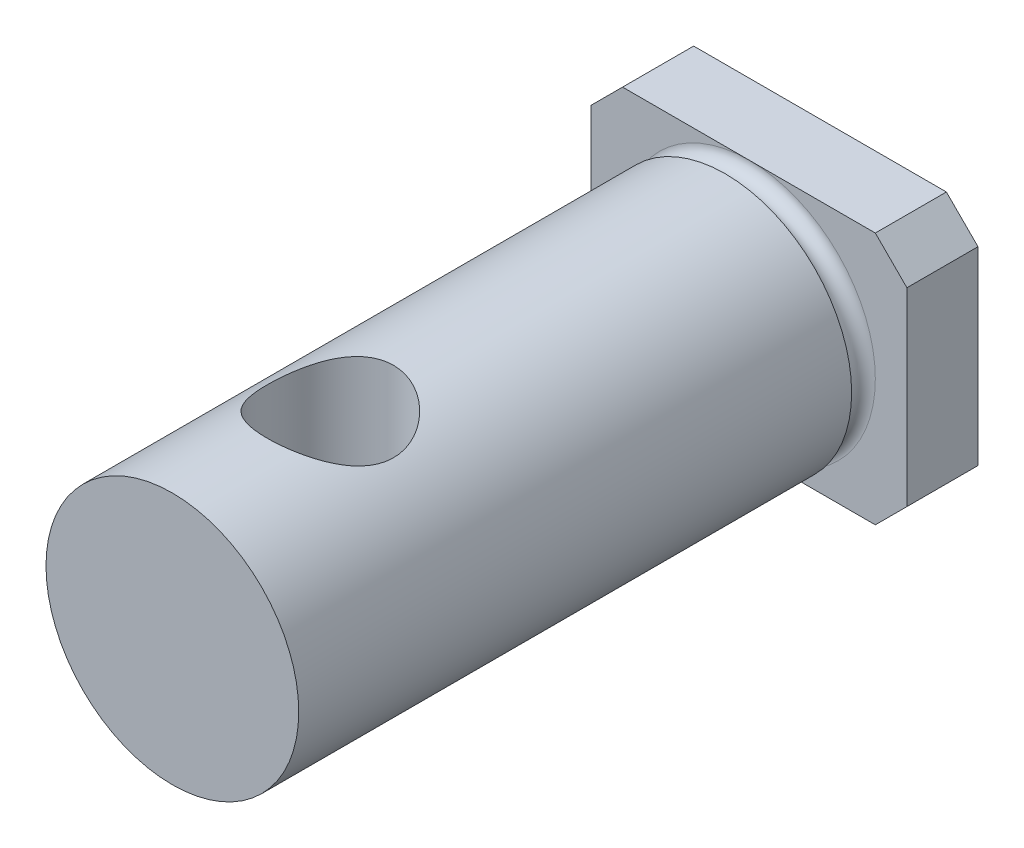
ISO-10303-21;
HEADER;
FILE_DESCRIPTION(('STEP AP214'),'2;1');
FILE_NAME('part.step','',(''),(''),'','','');
FILE_SCHEMA(('AUTOMOTIVE_DESIGN { 1 0 10303 214 1 1 1 1 }'));
ENDSEC;
DATA;
#1=APPLICATION_CONTEXT('core data for automotive mechanical design processes');
#2=APPLICATION_PROTOCOL_DEFINITION('international standard','automotive_design',2000,#1);
#3=PRODUCT_CONTEXT('',#1,'mechanical');
#4=PRODUCT('Part','Part','',(#3));
#5=PRODUCT_RELATED_PRODUCT_CATEGORY('part','',(#4));
#6=PRODUCT_DEFINITION_FORMATION('','',#4);
#7=PRODUCT_DEFINITION_CONTEXT('part definition',#1,'design');
#8=PRODUCT_DEFINITION('design','',#6,#7);
#9=PRODUCT_DEFINITION_SHAPE('','',#8);
#10=(LENGTH_UNIT() NAMED_UNIT(*) SI_UNIT(.MILLI.,.METRE.));
#11=(NAMED_UNIT(*) PLANE_ANGLE_UNIT() SI_UNIT($,.RADIAN.));
#12=(NAMED_UNIT(*) SI_UNIT($,.STERADIAN.) SOLID_ANGLE_UNIT());
#13=UNCERTAINTY_MEASURE_WITH_UNIT(LENGTH_MEASURE(1.E-05),#10,'distance_accuracy_value','');
#14=(GEOMETRIC_REPRESENTATION_CONTEXT(3) GLOBAL_UNCERTAINTY_ASSIGNED_CONTEXT((#13)) GLOBAL_UNIT_ASSIGNED_CONTEXT((#10,
#11,#12)) REPRESENTATION_CONTEXT('',''));
#15=CARTESIAN_POINT('',(0.,0.,0.));
#16=DIRECTION('',(0.,0.,1.));
#17=DIRECTION('',(1.,0.,0.));
#18=AXIS2_PLACEMENT_3D('',#15,#16,#17);
#19=CARTESIAN_POINT('',(0.,0.,20.5));
#20=DIRECTION('',(0.,0.,-1.));
#21=DIRECTION('',(-1.,0.,0.));
#22=AXIS2_PLACEMENT_3D('',#19,#20,#21);
#23=CYLINDRICAL_SURFACE('',#22,4.);
#24=CARTESIAN_POINT('',(0.,-4.,17.5));
#25=CARTESIAN_POINT('',(-0.105143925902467,-3.99999426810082,17.4999933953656));
#26=CARTESIAN_POINT('',(-0.210413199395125,-3.99580982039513,17.4916598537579));
#27=CARTESIAN_POINT('',(-0.417840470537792,-3.97948312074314,17.4586942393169));
#28=CARTESIAN_POINT('',(-0.519992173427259,-3.96732575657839,17.4340312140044));
#29=CARTESIAN_POINT('',(-0.717867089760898,-3.93632558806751,17.3696123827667));
#30=CARTESIAN_POINT('',(-0.813613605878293,-3.91750878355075,17.3299152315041));
#31=CARTESIAN_POINT('',(-0.996945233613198,-3.87491553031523,17.23685875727));
#32=CARTESIAN_POINT('',(-1.08453098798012,-3.8511394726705,17.1835005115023));
#33=CARTESIAN_POINT('',(-1.25501563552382,-3.79912516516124,17.0609655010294));
#34=CARTESIAN_POINT('',(-1.33731042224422,-3.77070398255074,16.9910270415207));
#35=CARTESIAN_POINT('',(-1.48955888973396,-3.71319940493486,16.8389570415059));
#36=CARTESIAN_POINT('',(-1.55950316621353,-3.68411552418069,16.7568162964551));
#37=CARTESIAN_POINT('',(-1.69050400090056,-3.62597902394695,16.5750333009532));
#38=CARTESIAN_POINT('',(-1.75045067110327,-3.59710373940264,16.4745278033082));
#39=CARTESIAN_POINT('',(-1.85233645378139,-3.54571957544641,16.2632653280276));
#40=CARTESIAN_POINT('',(-1.89428842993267,-3.52320615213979,16.1525157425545));
#41=CARTESIAN_POINT('',(-1.95626488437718,-3.48915734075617,15.9306697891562));
#42=CARTESIAN_POINT('',(-1.97745171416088,-3.47704543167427,15.8199910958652));
#43=CARTESIAN_POINT('',(-2.00085398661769,-3.46363779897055,15.596042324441));
#44=CARTESIAN_POINT('',(-2.00308817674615,-3.46233138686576,15.4827749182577));
#45=CARTESIAN_POINT('',(-1.98937457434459,-3.47021860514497,15.2714279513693));
#46=CARTESIAN_POINT('',(-1.97556911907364,-3.47817527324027,15.1731519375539));
#47=CARTESIAN_POINT('',(-1.93387969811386,-3.501524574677,14.9805561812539));
#48=CARTESIAN_POINT('',(-1.9059912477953,-3.51691957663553,14.8862377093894));
#49=CARTESIAN_POINT('',(-1.83641956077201,-3.55374952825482,14.7015417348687));
#50=CARTESIAN_POINT('',(-1.79443013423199,-3.57531681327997,14.6113072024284));
#51=CARTESIAN_POINT('',(-1.698083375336,-3.62206808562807,14.43873141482));
#52=CARTESIAN_POINT('',(-1.64372048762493,-3.64725369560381,14.3563937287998));
#53=CARTESIAN_POINT('',(-1.51613210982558,-3.70226315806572,14.1909574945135));
#54=CARTESIAN_POINT('',(-1.44138891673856,-3.73227020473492,14.1090862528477));
#55=CARTESIAN_POINT('',(-1.27911115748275,-3.79095246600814,13.9585291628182));
#56=CARTESIAN_POINT('',(-1.19157051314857,-3.81962703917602,13.8898496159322));
#57=CARTESIAN_POINT('',(-1.0010330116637,-3.87403974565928,13.7646286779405));
#58=CARTESIAN_POINT('',(-0.897507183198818,-3.89957968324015,13.7087990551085));
#59=CARTESIAN_POINT('',(-0.680932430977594,-3.94315762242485,13.615805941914));
#60=CARTESIAN_POINT('',(-0.567891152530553,-3.96120157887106,13.5786276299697));
#61=CARTESIAN_POINT('',(-0.345532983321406,-3.98648667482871,13.5270491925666));
#62=CARTESIAN_POINT('',(-0.236683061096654,-3.9944987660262,13.5110175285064));
#63=CARTESIAN_POINT('',(-0.0175591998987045,-4.00146026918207,13.497070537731));
#64=CARTESIAN_POINT('',(0.0927140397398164,-4.00041397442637,13.4991466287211));
#65=CARTESIAN_POINT('',(0.302465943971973,-3.9898238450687,13.5204133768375));
#66=CARTESIAN_POINT('',(0.40211881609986,-3.98094491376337,13.53826506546));
#67=CARTESIAN_POINT('',(0.596813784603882,-3.95644342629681,13.5884761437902));
#68=CARTESIAN_POINT('',(0.691855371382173,-3.94082012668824,13.620837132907));
#69=CARTESIAN_POINT('',(0.877777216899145,-3.90368502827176,13.6999969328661));
#70=CARTESIAN_POINT('',(0.968460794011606,-3.88201763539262,13.7471821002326));
#71=CARTESIAN_POINT('',(1.14092272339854,-3.83487948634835,13.8542150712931));
#72=CARTESIAN_POINT('',(1.22269725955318,-3.80940711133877,13.9140682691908));
#73=CARTESIAN_POINT('',(1.38353537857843,-3.75416442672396,14.0515208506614));
#74=CARTESIAN_POINT('',(1.46154415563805,-3.72421769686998,14.1302857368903));
#75=CARTESIAN_POINT('',(1.60371264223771,-3.6652478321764,14.2998503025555));
#76=CARTESIAN_POINT('',(1.66786277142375,-3.63622534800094,14.3906582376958));
#77=CARTESIAN_POINT('',(1.78341582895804,-3.58102384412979,14.587287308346));
#78=CARTESIAN_POINT('',(1.8340509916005,-3.55505059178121,14.693622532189));
#79=CARTESIAN_POINT('',(1.91616565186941,-3.51148144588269,14.9150201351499));
#80=CARTESIAN_POINT('',(1.94766983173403,-3.493874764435,15.0300710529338));
#81=CARTESIAN_POINT('',(1.98772337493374,-3.47123002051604,15.2538204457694));
#82=CARTESIAN_POINT('',(1.9981859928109,-3.4651476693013,15.3620685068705));
#83=CARTESIAN_POINT('',(2.0013783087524,-3.46330709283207,15.5788941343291));
#84=CARTESIAN_POINT('',(1.99411569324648,-3.4675443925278,15.6874715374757));
#85=CARTESIAN_POINT('',(1.96385225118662,-3.48475724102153,15.8909670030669));
#86=CARTESIAN_POINT('',(1.94241662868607,-3.49686188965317,15.9862009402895));
#87=CARTESIAN_POINT('',(1.88635071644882,-3.52742032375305,16.1716162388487));
#88=CARTESIAN_POINT('',(1.85171618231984,-3.54587615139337,16.2617959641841));
#89=CARTESIAN_POINT('',(1.76763149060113,-3.58857060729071,16.4412497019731));
#90=CARTESIAN_POINT('',(1.7173422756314,-3.61311444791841,16.5300558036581));
#91=CARTESIAN_POINT('',(1.60430194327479,-3.66470663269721,16.6985490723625));
#92=CARTESIAN_POINT('',(1.54154434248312,-3.69175627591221,16.7782314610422));
#93=CARTESIAN_POINT('',(1.39640665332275,-3.74924646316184,16.9362839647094));
#94=CARTESIAN_POINT('',(1.31256884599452,-3.77969966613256,17.0133182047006));
#95=CARTESIAN_POINT('',(1.13230961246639,-3.83755504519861,17.1525259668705));
#96=CARTESIAN_POINT('',(1.03588144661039,-3.8649555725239,17.2146914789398));
#97=CARTESIAN_POINT('',(0.831863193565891,-3.91396019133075,17.3224727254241));
#98=CARTESIAN_POINT('',(0.724199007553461,-3.93552192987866,17.3679683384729));
#99=CARTESIAN_POINT('',(0.501484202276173,-3.97002682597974,17.4396163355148));
#100=CARTESIAN_POINT('',(0.386455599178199,-3.98299446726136,17.4658236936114));
#101=CARTESIAN_POINT('',(0.22520389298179,-3.99390923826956,17.4877948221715));
#102=CARTESIAN_POINT('',(0.180323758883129,-3.99618730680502,17.4923652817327));
#103=CARTESIAN_POINT('',(0.0903034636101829,-3.99923393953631,17.4984693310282));
#104=CARTESIAN_POINT('',(0.0451632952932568,-4.00000246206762,17.5000028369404));
#105=CARTESIAN_POINT('',(0.,-4.,17.5));
#106=B_SPLINE_CURVE_WITH_KNOTS('',3,(#24,#25,#26,#27,#28,#29,#30,#31,#32,#33,#34,#35,#36,#37,
#38,#39,#40,#41,#42,#43,#44,#45,#46,#47,#48,#49,#50,#51,#52,#53,#54,#55,#56,#57,#58,#59,#60,#61,
#62,#63,#64,#65,#66,#67,#68,#69,#70,#71,#72,#73,#74,#75,#76,#77,#78,#79,#80,#81,#82,#83,#84,#85,
#86,#87,#88,#89,#90,#91,#92,#93,#94,#95,#96,#97,#98,#99,#100,#101,#102,#103,#104,#105),
.UNSPECIFIED.,.T.,.F.,(4,2,2,2,2,2,2,2,2,2,2,2,2,2,2,2,2,2,2,2,2,2,2,2,2,2,2,2,2,2,2,2,2,2,2,2,
2,2,2,2,4),(0.,0.315248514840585,0.631096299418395,0.945724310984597,1.26032752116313,
1.59396351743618,1.92785247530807,2.28763452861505,2.64715895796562,2.98516024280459,
3.32282714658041,3.62011424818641,3.91749607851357,4.22180480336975,4.52625042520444,
4.86929882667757,5.21251069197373,5.57166044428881,5.93052433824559,6.25966580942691,
6.58865129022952,6.89213813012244,7.19565843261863,7.50785712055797,7.82018901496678,
8.16319221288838,8.50643177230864,8.86629364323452,9.22569023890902,9.55058615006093,
9.87534119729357,10.1691586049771,10.463070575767,10.7767291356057,11.0905512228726,
11.4425048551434,11.7946476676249,12.1492802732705,12.502898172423,12.6383056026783,
12.7737167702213),.UNSPECIFIED.);
#107=CARTESIAN_POINT('',(0.,-4.,17.5));
#108=VERTEX_POINT('',#107);
#109=EDGE_CURVE('E202',#108,#108,#106,.T.);
#110=ORIENTED_EDGE('',*,*,#109,.F.);
#111=EDGE_LOOP('',(#110));
#112=FACE_BOUND('',#111,.T.);
#113=CARTESIAN_POINT('',(0.,0.,20.5));
#114=DIRECTION('',(0.,0.,1.));
#115=DIRECTION('',(1.,0.,0.));
#116=AXIS2_PLACEMENT_3D('',#113,#114,#115);
#117=CIRCLE('',#116,4.);
#118=CARTESIAN_POINT('',(4.,0.,20.5));
#119=VERTEX_POINT('',#118);
#120=EDGE_CURVE('E106',#119,#119,#117,.T.);
#121=ORIENTED_EDGE('',*,*,#120,.F.);
#122=EDGE_LOOP('',(#121));
#123=FACE_BOUND('',#122,.T.);
#124=CARTESIAN_POINT('',(0.,0.,3.));
#125=DIRECTION('',(0.,0.,-1.));
#126=DIRECTION('',(-1.,0.,0.));
#127=AXIS2_PLACEMENT_3D('',#124,#125,#126);
#128=CIRCLE('',#127,4.);
#129=CARTESIAN_POINT('',(-4.,0.,3.));
#130=VERTEX_POINT('',#129);
#131=EDGE_CURVE('E34',#130,#130,#128,.T.);
#132=ORIENTED_EDGE('',*,*,#131,.F.);
#133=EDGE_LOOP('',(#132));
#134=FACE_BOUND('',#133,.T.);
#135=CARTESIAN_POINT('',(0.,4.,13.5));
#136=CARTESIAN_POINT('',(0.105143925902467,3.99999426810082,13.5000066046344));
#137=CARTESIAN_POINT('',(0.210413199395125,3.99580982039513,13.5083401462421));
#138=CARTESIAN_POINT('',(0.417840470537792,3.97948312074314,13.5413057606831));
#139=CARTESIAN_POINT('',(0.519992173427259,3.96732575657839,13.5659687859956));
#140=CARTESIAN_POINT('',(0.717867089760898,3.93632558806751,13.6303876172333));
#141=CARTESIAN_POINT('',(0.813613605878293,3.91750878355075,13.6700847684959));
#142=CARTESIAN_POINT('',(0.996945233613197,3.87491553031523,13.76314124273));
#143=CARTESIAN_POINT('',(1.08453098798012,3.85113947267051,13.8164994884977));
#144=CARTESIAN_POINT('',(1.25501563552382,3.79912516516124,13.9390344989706));
#145=CARTESIAN_POINT('',(1.33731042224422,3.77070398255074,14.0089729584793));
#146=CARTESIAN_POINT('',(1.48955888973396,3.71319940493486,14.1610429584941));
#147=CARTESIAN_POINT('',(1.55950316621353,3.68411552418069,14.2431837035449));
#148=CARTESIAN_POINT('',(1.69050400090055,3.62597902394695,14.4249666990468));
#149=CARTESIAN_POINT('',(1.75045067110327,3.59710373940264,14.5254721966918));
#150=CARTESIAN_POINT('',(1.85233645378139,3.54571957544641,14.7367346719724));
#151=CARTESIAN_POINT('',(1.89428842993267,3.52320615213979,14.8474842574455));
#152=CARTESIAN_POINT('',(1.95626488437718,3.48915734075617,15.0693302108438));
#153=CARTESIAN_POINT('',(1.97745171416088,3.47704543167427,15.1800089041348));
#154=CARTESIAN_POINT('',(2.00085398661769,3.46363779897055,15.403957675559));
#155=CARTESIAN_POINT('',(2.00308817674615,3.46233138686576,15.5172250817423));
#156=CARTESIAN_POINT('',(1.98937457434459,3.47021860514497,15.7285720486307));
#157=CARTESIAN_POINT('',(1.97556911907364,3.47817527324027,15.8268480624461));
#158=CARTESIAN_POINT('',(1.93387969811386,3.501524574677,16.0194438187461));
#159=CARTESIAN_POINT('',(1.9059912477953,3.51691957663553,16.1137622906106));
#160=CARTESIAN_POINT('',(1.83641956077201,3.55374952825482,16.2984582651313));
#161=CARTESIAN_POINT('',(1.79443013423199,3.57531681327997,16.3886927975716));
#162=CARTESIAN_POINT('',(1.69808337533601,3.62206808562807,16.56126858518));
#163=CARTESIAN_POINT('',(1.64372048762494,3.64725369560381,16.6436062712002));
#164=CARTESIAN_POINT('',(1.51613210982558,3.70226315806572,16.8090425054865));
#165=CARTESIAN_POINT('',(1.44138891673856,3.73227020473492,16.8909137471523));
#166=CARTESIAN_POINT('',(1.27911115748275,3.79095246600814,17.0414708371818));
#167=CARTESIAN_POINT('',(1.19157051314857,3.81962703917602,17.1101503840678));
#168=CARTESIAN_POINT('',(1.0010330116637,3.87403974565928,17.2353713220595));
#169=CARTESIAN_POINT('',(0.897507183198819,3.89957968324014,17.2912009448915));
#170=CARTESIAN_POINT('',(0.680932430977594,3.94315762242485,17.384194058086));
#171=CARTESIAN_POINT('',(0.567891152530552,3.96120157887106,17.4213723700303));
#172=CARTESIAN_POINT('',(0.345532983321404,3.98648667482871,17.4729508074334));
#173=CARTESIAN_POINT('',(0.236683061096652,3.9944987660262,17.4889824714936));
#174=CARTESIAN_POINT('',(0.0175591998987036,4.00146026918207,17.502929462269));
#175=CARTESIAN_POINT('',(-0.092714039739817,4.00041397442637,17.5008533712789));
#176=CARTESIAN_POINT('',(-0.302465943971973,3.9898238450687,17.4795866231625));
#177=CARTESIAN_POINT('',(-0.402118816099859,3.98094491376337,17.46173493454));
#178=CARTESIAN_POINT('',(-0.596813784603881,3.95644342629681,17.4115238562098));
#179=CARTESIAN_POINT('',(-0.691855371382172,3.94082012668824,17.379162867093));
#180=CARTESIAN_POINT('',(-0.877777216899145,3.90368502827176,17.3000030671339));
#181=CARTESIAN_POINT('',(-0.968460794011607,3.88201763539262,17.2528178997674));
#182=CARTESIAN_POINT('',(-1.14092272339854,3.83487948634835,17.1457849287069));
#183=CARTESIAN_POINT('',(-1.22269725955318,3.80940711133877,17.0859317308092));
#184=CARTESIAN_POINT('',(-1.38353537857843,3.75416442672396,16.9484791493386));
#185=CARTESIAN_POINT('',(-1.46154415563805,3.72421769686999,16.8697142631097));
#186=CARTESIAN_POINT('',(-1.60371264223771,3.6652478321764,16.7001496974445));
#187=CARTESIAN_POINT('',(-1.66786277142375,3.63622534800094,16.6093417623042));
#188=CARTESIAN_POINT('',(-1.78341582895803,3.58102384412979,16.4127126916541));
#189=CARTESIAN_POINT('',(-1.8340509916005,3.55505059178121,16.306377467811));
#190=CARTESIAN_POINT('',(-1.91616565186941,3.51148144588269,16.0849798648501));
#191=CARTESIAN_POINT('',(-1.94766983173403,3.493874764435,15.9699289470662));
#192=CARTESIAN_POINT('',(-1.98772337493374,3.47123002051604,15.7461795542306));
#193=CARTESIAN_POINT('',(-1.9981859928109,3.4651476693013,15.6379314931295));
#194=CARTESIAN_POINT('',(-2.0013783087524,3.46330709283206,15.421105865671));
#195=CARTESIAN_POINT('',(-1.99411569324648,3.4675443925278,15.3125284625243));
#196=CARTESIAN_POINT('',(-1.96385225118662,3.48475724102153,15.1090329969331));
#197=CARTESIAN_POINT('',(-1.94241662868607,3.49686188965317,15.0137990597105));
#198=CARTESIAN_POINT('',(-1.88635071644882,3.52742032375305,14.8283837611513));
#199=CARTESIAN_POINT('',(-1.85171618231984,3.54587615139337,14.7382040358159));
#200=CARTESIAN_POINT('',(-1.76763149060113,3.58857060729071,14.5587502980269));
#201=CARTESIAN_POINT('',(-1.7173422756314,3.61311444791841,14.4699441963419));
#202=CARTESIAN_POINT('',(-1.60430194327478,3.66470663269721,14.3014509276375));
#203=CARTESIAN_POINT('',(-1.54154434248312,3.69175627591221,14.2217685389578));
#204=CARTESIAN_POINT('',(-1.39640665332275,3.74924646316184,14.0637160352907));
#205=CARTESIAN_POINT('',(-1.31256884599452,3.77969966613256,13.9866817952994));
#206=CARTESIAN_POINT('',(-1.1323096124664,3.83755504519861,13.8474740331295));
#207=CARTESIAN_POINT('',(-1.0358814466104,3.8649555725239,13.7853085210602));
#208=CARTESIAN_POINT('',(-0.831863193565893,3.91396019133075,13.6775272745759));
#209=CARTESIAN_POINT('',(-0.724199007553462,3.93552192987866,13.6320316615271));
#210=CARTESIAN_POINT('',(-0.501484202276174,3.97002682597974,13.5603836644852));
#211=CARTESIAN_POINT('',(-0.3864555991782,3.98299446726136,13.5341763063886));
#212=CARTESIAN_POINT('',(-0.225203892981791,3.99390923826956,13.5122051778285));
#213=CARTESIAN_POINT('',(-0.18032375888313,3.99618730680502,13.5076347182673));
#214=CARTESIAN_POINT('',(-0.0903034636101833,3.99923393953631,13.5015306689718));
#215=CARTESIAN_POINT('',(-0.0451632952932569,4.00000246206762,13.4999971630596));
#216=CARTESIAN_POINT('',(0.,4.,13.5));
#217=B_SPLINE_CURVE_WITH_KNOTS('',3,(#135,#136,#137,#138,#139,#140,#141,#142,#143,#144,#145,
#146,#147,#148,#149,#150,#151,#152,#153,#154,#155,#156,#157,#158,#159,#160,#161,#162,#163,#164,
#165,#166,#167,#168,#169,#170,#171,#172,#173,#174,#175,#176,#177,#178,#179,#180,#181,#182,#183,
#184,#185,#186,#187,#188,#189,#190,#191,#192,#193,#194,#195,#196,#197,#198,#199,#200,#201,#202,
#203,#204,#205,#206,#207,#208,#209,#210,#211,#212,#213,#214,#215,#216),.UNSPECIFIED.,.T.,.F.,(4,
2,2,2,2,2,2,2,2,2,2,2,2,2,2,2,2,2,2,2,2,2,2,2,2,2,2,2,2,2,2,2,2,2,2,2,2,2,2,2,4),(0.,
0.315248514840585,0.631096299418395,0.945724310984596,1.26032752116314,1.59396351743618,
1.92785247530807,2.28763452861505,2.64715895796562,2.98516024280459,3.32282714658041,
3.62011424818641,3.91749607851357,4.22180480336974,4.52625042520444,4.86929882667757,
5.21251069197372,5.57166044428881,5.93052433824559,6.25966580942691,6.58865129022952,
6.89213813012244,7.19565843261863,7.50785712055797,7.82018901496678,8.16319221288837,
8.50643177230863,8.86629364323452,9.22569023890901,9.55058615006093,9.87534119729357,
10.1691586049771,10.463070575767,10.7767291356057,11.0905512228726,11.4425048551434,
11.7946476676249,12.1492802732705,12.502898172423,12.6383056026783,12.7737167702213),.UNSPECIFIED.);
#218=CARTESIAN_POINT('',(0.,4.,13.5));
#219=VERTEX_POINT('',#218);
#220=EDGE_CURVE('E195',#219,#219,#217,.T.);
#221=ORIENTED_EDGE('',*,*,#220,.T.);
#222=EDGE_LOOP('',(#221));
#223=FACE_BOUND('',#222,.T.);
#224=ADVANCED_FACE('F30',(#112,#123,#134,#223),#23,.T.);
#225=CARTESIAN_POINT('',(-5.,-4.,2.25));
#226=DIRECTION('',(0.,0.,1.));
#227=DIRECTION('',(1.,0.,0.));
#228=AXIS2_PLACEMENT_3D('',#225,#226,#227);
#229=PLANE('',#228);
#230=DIRECTION('',(1.,0.,0.));
#231=VECTOR('',#230,1.);
#232=CARTESIAN_POINT('',(-5.,-4.,2.25));
#233=LINE('',#232,#231);
#234=CARTESIAN_POINT('',(-3.99999999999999,-4.,2.25));
#235=VERTEX_POINT('',#234);
#236=CARTESIAN_POINT('',(0.,-4.,2.25));
#237=VERTEX_POINT('',#236);
#238=EDGE_CURVE('E115',#235,#237,#233,.T.);
#239=ORIENTED_EDGE('',*,*,#238,.T.);
#240=CARTESIAN_POINT('',(0.,0.,2.25));
#241=DIRECTION('',(0.,0.,1.));
#242=DIRECTION('',(1.,0.,0.));
#243=AXIS2_PLACEMENT_3D('',#240,#241,#242);
#244=CIRCLE('',#243,4.);
#245=CARTESIAN_POINT('',(0.,4.,2.25));
#246=VERTEX_POINT('',#245);
#247=EDGE_CURVE('E45',#237,#246,#244,.F.);
#248=ORIENTED_EDGE('',*,*,#247,.T.);
#249=DIRECTION('',(-1.,0.,0.));
#250=VECTOR('',#249,1.);
#251=CARTESIAN_POINT('',(-5.,4.,2.25));
#252=LINE('',#251,#250);
#253=CARTESIAN_POINT('',(-3.99999999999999,4.,2.25));
#254=VERTEX_POINT('',#253);
#255=EDGE_CURVE('E112',#246,#254,#252,.T.);
#256=ORIENTED_EDGE('',*,*,#255,.T.);
#257=DIRECTION('',(0.707106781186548,0.707106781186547,0.));
#258=VECTOR('',#257,1.);
#259=CARTESIAN_POINT('',(-8.5,-0.499999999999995,2.25));
#260=LINE('',#259,#258);
#261=CARTESIAN_POINT('',(-5.,3.,2.25));
#262=VERTEX_POINT('',#261);
#263=EDGE_CURVE('E166',#254,#262,#260,.F.);
#264=ORIENTED_EDGE('',*,*,#263,.T.);
#265=DIRECTION('',(0.,-1.,0.));
#266=VECTOR('',#265,1.);
#267=CARTESIAN_POINT('',(-5.,4.,2.25));
#268=LINE('',#267,#266);
#269=CARTESIAN_POINT('',(-5.,-3.,2.25));
#270=VERTEX_POINT('',#269);
#271=EDGE_CURVE('E144',#262,#270,#268,.T.);
#272=ORIENTED_EDGE('',*,*,#271,.T.);
#273=DIRECTION('',(-0.707106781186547,0.707106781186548,0.));
#274=VECTOR('',#273,1.);
#275=CARTESIAN_POINT('',(-4.5,-3.5,2.25));
#276=LINE('',#275,#274);
#277=EDGE_CURVE('E164',#270,#235,#276,.F.);
#278=ORIENTED_EDGE('',*,*,#277,.T.);
#279=EDGE_LOOP('',(#239,#248,#256,#264,#272,#278));
#280=FACE_BOUND('',#279,.T.);
#281=ADVANCED_FACE('F111',(#280),#229,.T.);
#282=CARTESIAN_POINT('',(4.,4.,2.25));
#283=VERTEX_POINT('',#282);
#284=EDGE_CURVE('E121',#283,#246,#252,.T.);
#285=ORIENTED_EDGE('',*,*,#284,.T.);
#286=EDGE_CURVE('E100',#246,#237,#244,.F.);
#287=ORIENTED_EDGE('',*,*,#286,.T.);
#288=CARTESIAN_POINT('',(3.99999999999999,-4.,2.25));
#289=VERTEX_POINT('',#288);
#290=EDGE_CURVE('E189',#237,#289,#233,.T.);
#291=ORIENTED_EDGE('',*,*,#290,.T.);
#292=DIRECTION('',(-0.707106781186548,-0.707106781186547,0.));
#293=VECTOR('',#292,1.);
#294=CARTESIAN_POINT('',(-0.50000000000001,-8.49999999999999,2.25));
#295=LINE('',#294,#293);
#296=CARTESIAN_POINT('',(5.,-3.,2.25));
#297=VERTEX_POINT('',#296);
#298=EDGE_CURVE('E162',#289,#297,#295,.F.);
#299=ORIENTED_EDGE('',*,*,#298,.T.);
#300=DIRECTION('',(0.,1.,0.));
#301=VECTOR('',#300,1.);
#302=CARTESIAN_POINT('',(5.,4.,2.25));
#303=LINE('',#302,#301);
#304=CARTESIAN_POINT('',(5.,3.,2.25));
#305=VERTEX_POINT('',#304);
#306=EDGE_CURVE('E126',#297,#305,#303,.T.);
#307=ORIENTED_EDGE('',*,*,#306,.T.);
#308=DIRECTION('',(0.707106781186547,-0.707106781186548,0.));
#309=VECTOR('',#308,1.);
#310=CARTESIAN_POINT('',(3.50000000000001,4.49999999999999,2.25));
#311=LINE('',#310,#309);
#312=EDGE_CURVE('E130',#305,#283,#311,.F.);
#313=ORIENTED_EDGE('',*,*,#312,.T.);
#314=EDGE_LOOP('',(#285,#287,#291,#299,#307,#313));
#315=FACE_BOUND('',#314,.T.);
#316=ADVANCED_FACE('F128',(#315),#229,.T.);
#317=CARTESIAN_POINT('',(-5.,4.,2.25));
#318=DIRECTION('',(1.,0.,0.));
#319=DIRECTION('',(0.,0.,-1.));
#320=AXIS2_PLACEMENT_3D('',#317,#318,#319);
#321=PLANE('',#320);
#322=ORIENTED_EDGE('',*,*,#271,.F.);
#323=DIRECTION('',(0.,0.,-1.));
#324=VECTOR('',#323,1.);
#325=CARTESIAN_POINT('',(-5.,3.,2.25));
#326=LINE('',#325,#324);
#327=CARTESIAN_POINT('',(-5.,3.,0.));
#328=VERTEX_POINT('',#327);
#329=EDGE_CURVE('E132',#262,#328,#326,.T.);
#330=ORIENTED_EDGE('',*,*,#329,.T.);
#331=DIRECTION('',(0.,-1.,0.));
#332=VECTOR('',#331,1.);
#333=CARTESIAN_POINT('',(-5.,4.,0.));
#334=LINE('',#333,#332);
#335=CARTESIAN_POINT('',(-5.,-3.,0.));
#336=VERTEX_POINT('',#335);
#337=EDGE_CURVE('E116',#328,#336,#334,.T.);
#338=ORIENTED_EDGE('',*,*,#337,.T.);
#339=DIRECTION('',(0.,0.,1.));
#340=VECTOR('',#339,1.);
#341=CARTESIAN_POINT('',(-5.,-3.,2.25));
#342=LINE('',#341,#340);
#343=EDGE_CURVE('E131',#336,#270,#342,.T.);
#344=ORIENTED_EDGE('',*,*,#343,.T.);
#345=EDGE_LOOP('',(#322,#330,#338,#344));
#346=FACE_BOUND('',#345,.T.);
#347=ADVANCED_FACE('F236',(#346),#321,.F.);
#348=CARTESIAN_POINT('',(-5.,-4.,2.25));
#349=DIRECTION('',(0.,1.,0.));
#350=DIRECTION('',(0.,0.,1.));
#351=AXIS2_PLACEMENT_3D('',#348,#349,#350);
#352=PLANE('',#351);
#353=DIRECTION('',(1.,0.,0.));
#354=VECTOR('',#353,1.);
#355=CARTESIAN_POINT('',(-5.,-4.,0.));
#356=LINE('',#355,#354);
#357=CARTESIAN_POINT('',(-3.99999999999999,-4.,0.));
#358=VERTEX_POINT('',#357);
#359=CARTESIAN_POINT('',(3.99999999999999,-4.,0.));
#360=VERTEX_POINT('',#359);
#361=EDGE_CURVE('E139',#358,#360,#356,.T.);
#362=ORIENTED_EDGE('',*,*,#361,.T.);
#363=DIRECTION('',(0.,0.,1.));
#364=VECTOR('',#363,1.);
#365=CARTESIAN_POINT('',(3.99999999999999,-4.,2.25));
#366=LINE('',#365,#364);
#367=EDGE_CURVE('E168',#360,#289,#366,.T.);
#368=ORIENTED_EDGE('',*,*,#367,.T.);
#369=ORIENTED_EDGE('',*,*,#290,.F.);
#370=ORIENTED_EDGE('',*,*,#238,.F.);
#371=DIRECTION('',(0.,0.,-1.));
#372=VECTOR('',#371,1.);
#373=CARTESIAN_POINT('',(-3.99999999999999,-4.,2.25));
#374=LINE('',#373,#372);
#375=EDGE_CURVE('E171',#235,#358,#374,.T.);
#376=ORIENTED_EDGE('',*,*,#375,.T.);
#377=EDGE_LOOP('',(#362,#368,#369,#370,#376));
#378=FACE_BOUND('',#377,.T.);
#379=ADVANCED_FACE('F177',(#378),#352,.F.);
#380=CARTESIAN_POINT('',(5.,4.,2.25));
#381=DIRECTION('',(-1.,0.,0.));
#382=DIRECTION('',(0.,0.,1.));
#383=AXIS2_PLACEMENT_3D('',#380,#381,#382);
#384=PLANE('',#383);
#385=ORIENTED_EDGE('',*,*,#306,.F.);
#386=DIRECTION('',(0.,0.,-1.));
#387=VECTOR('',#386,1.);
#388=CARTESIAN_POINT('',(5.,-3.,2.25));
#389=LINE('',#388,#387);
#390=CARTESIAN_POINT('',(5.,-3.,0.));
#391=VERTEX_POINT('',#390);
#392=EDGE_CURVE('E11',#297,#391,#389,.T.);
#393=ORIENTED_EDGE('',*,*,#392,.T.);
#394=DIRECTION('',(0.,1.,0.));
#395=VECTOR('',#394,1.);
#396=CARTESIAN_POINT('',(5.,4.,0.));
#397=LINE('',#396,#395);
#398=CARTESIAN_POINT('',(5.,3.,0.));
#399=VERTEX_POINT('',#398);
#400=EDGE_CURVE('E141',#391,#399,#397,.T.);
#401=ORIENTED_EDGE('',*,*,#400,.T.);
#402=DIRECTION('',(0.,0.,1.));
#403=VECTOR('',#402,1.);
#404=CARTESIAN_POINT('',(5.,3.,2.25));
#405=LINE('',#404,#403);
#406=EDGE_CURVE('E39',#399,#305,#405,.T.);
#407=ORIENTED_EDGE('',*,*,#406,.T.);
#408=EDGE_LOOP('',(#385,#393,#401,#407));
#409=FACE_BOUND('',#408,.T.);
#410=ADVANCED_FACE('F231',(#409),#384,.F.);
#411=CARTESIAN_POINT('',(-5.,4.,2.25));
#412=DIRECTION('',(0.,-1.,0.));
#413=DIRECTION('',(0.,0.,-1.));
#414=AXIS2_PLACEMENT_3D('',#411,#412,#413);
#415=PLANE('',#414);
#416=DIRECTION('',(-1.,0.,0.));
#417=VECTOR('',#416,1.);
#418=CARTESIAN_POINT('',(-5.,4.,0.));
#419=LINE('',#418,#417);
#420=CARTESIAN_POINT('',(3.99999999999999,4.,0.));
#421=VERTEX_POINT('',#420);
#422=CARTESIAN_POINT('',(-3.99999999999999,4.,0.));
#423=VERTEX_POINT('',#422);
#424=EDGE_CURVE('E143',#421,#423,#419,.T.);
#425=ORIENTED_EDGE('',*,*,#424,.T.);
#426=DIRECTION('',(0.,0.,1.));
#427=VECTOR('',#426,1.);
#428=CARTESIAN_POINT('',(-3.99999999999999,4.,2.25));
#429=LINE('',#428,#427);
#430=EDGE_CURVE('E124',#423,#254,#429,.T.);
#431=ORIENTED_EDGE('',*,*,#430,.T.);
#432=ORIENTED_EDGE('',*,*,#255,.F.);
#433=ORIENTED_EDGE('',*,*,#284,.F.);
#434=DIRECTION('',(0.,0.,-1.));
#435=VECTOR('',#434,1.);
#436=CARTESIAN_POINT('',(3.99999999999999,4.,2.25));
#437=LINE('',#436,#435);
#438=EDGE_CURVE('E158',#283,#421,#437,.T.);
#439=ORIENTED_EDGE('',*,*,#438,.T.);
#440=EDGE_LOOP('',(#425,#431,#432,#433,#439));
#441=FACE_BOUND('',#440,.T.);
#442=ADVANCED_FACE('F119',(#441),#415,.F.);
#443=CARTESIAN_POINT('',(-5.,-4.,0.));
#444=DIRECTION('',(0.,0.,1.));
#445=DIRECTION('',(1.,0.,0.));
#446=AXIS2_PLACEMENT_3D('',#443,#444,#445);
#447=PLANE('',#446);
#448=DIRECTION('',(0.707106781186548,0.707106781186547,0.));
#449=VECTOR('',#448,1.);
#450=CARTESIAN_POINT('',(5.,-3.,0.));
#451=LINE('',#450,#449);
#452=EDGE_CURVE('E150',#391,#360,#451,.F.);
#453=ORIENTED_EDGE('',*,*,#452,.T.);
#454=ORIENTED_EDGE('',*,*,#361,.F.);
#455=DIRECTION('',(0.707106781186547,-0.707106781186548,0.));
#456=VECTOR('',#455,1.);
#457=CARTESIAN_POINT('',(-3.99999999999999,-4.,0.));
#458=LINE('',#457,#456);
#459=EDGE_CURVE('E153',#358,#336,#458,.F.);
#460=ORIENTED_EDGE('',*,*,#459,.T.);
#461=ORIENTED_EDGE('',*,*,#337,.F.);
#462=DIRECTION('',(-0.707106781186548,-0.707106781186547,0.));
#463=VECTOR('',#462,1.);
#464=CARTESIAN_POINT('',(-5.,3.,0.));
#465=LINE('',#464,#463);
#466=EDGE_CURVE('E155',#328,#423,#465,.F.);
#467=ORIENTED_EDGE('',*,*,#466,.T.);
#468=ORIENTED_EDGE('',*,*,#424,.F.);
#469=DIRECTION('',(-0.707106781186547,0.707106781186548,0.));
#470=VECTOR('',#469,1.);
#471=CARTESIAN_POINT('',(3.99999999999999,4.,0.));
#472=LINE('',#471,#470);
#473=EDGE_CURVE('E148',#421,#399,#472,.F.);
#474=ORIENTED_EDGE('',*,*,#473,.T.);
#475=ORIENTED_EDGE('',*,*,#400,.F.);
#476=EDGE_LOOP('',(#453,#454,#460,#461,#467,#468,#474,#475));
#477=FACE_BOUND('',#476,.T.);
#478=ADVANCED_FACE('F181',(#477),#447,.F.);
#479=CARTESIAN_POINT('',(-5.,3.,2.25));
#480=DIRECTION('',(0.707106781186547,-0.707106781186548,0.));
#481=DIRECTION('',(0.707106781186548,0.707106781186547,0.));
#482=AXIS2_PLACEMENT_3D('',#479,#480,#481);
#483=PLANE('',#482);
#484=ORIENTED_EDGE('',*,*,#263,.F.);
#485=ORIENTED_EDGE('',*,*,#430,.F.);
#486=ORIENTED_EDGE('',*,*,#466,.F.);
#487=ORIENTED_EDGE('',*,*,#329,.F.);
#488=EDGE_LOOP('',(#484,#485,#486,#487));
#489=FACE_BOUND('',#488,.T.);
#490=ADVANCED_FACE('F228',(#489),#483,.F.);
#491=CARTESIAN_POINT('',(-3.99999999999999,-4.,2.25));
#492=DIRECTION('',(0.707106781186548,0.707106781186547,0.));
#493=DIRECTION('',(-0.707106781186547,0.707106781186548,0.));
#494=AXIS2_PLACEMENT_3D('',#491,#492,#493);
#495=PLANE('',#494);
#496=ORIENTED_EDGE('',*,*,#277,.F.);
#497=ORIENTED_EDGE('',*,*,#343,.F.);
#498=ORIENTED_EDGE('',*,*,#459,.F.);
#499=ORIENTED_EDGE('',*,*,#375,.F.);
#500=EDGE_LOOP('',(#496,#497,#498,#499));
#501=FACE_BOUND('',#500,.T.);
#502=ADVANCED_FACE('F242',(#501),#495,.F.);
#503=CARTESIAN_POINT('',(5.,-3.,2.25));
#504=DIRECTION('',(-0.707106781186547,0.707106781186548,0.));
#505=DIRECTION('',(-0.707106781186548,-0.707106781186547,0.));
#506=AXIS2_PLACEMENT_3D('',#503,#504,#505);
#507=PLANE('',#506);
#508=ORIENTED_EDGE('',*,*,#298,.F.);
#509=ORIENTED_EDGE('',*,*,#367,.F.);
#510=ORIENTED_EDGE('',*,*,#452,.F.);
#511=ORIENTED_EDGE('',*,*,#392,.F.);
#512=EDGE_LOOP('',(#508,#509,#510,#511));
#513=FACE_BOUND('',#512,.T.);
#514=ADVANCED_FACE('F188',(#513),#507,.F.);
#515=CARTESIAN_POINT('',(3.99999999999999,4.,2.25));
#516=DIRECTION('',(-0.707106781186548,-0.707106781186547,0.));
#517=DIRECTION('',(0.707106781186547,-0.707106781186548,0.));
#518=AXIS2_PLACEMENT_3D('',#515,#516,#517);
#519=PLANE('',#518);
#520=ORIENTED_EDGE('',*,*,#312,.F.);
#521=ORIENTED_EDGE('',*,*,#406,.F.);
#522=ORIENTED_EDGE('',*,*,#473,.F.);
#523=ORIENTED_EDGE('',*,*,#438,.F.);
#524=EDGE_LOOP('',(#520,#521,#522,#523));
#525=FACE_BOUND('',#524,.T.);
#526=ADVANCED_FACE('F32',(#525),#519,.F.);
#527=CARTESIAN_POINT('',(0.,0.,2.625));
#528=DIRECTION('',(0.,0.,1.));
#529=DIRECTION('',(1.,0.,0.));
#530=AXIS2_PLACEMENT_3D('',#527,#528,#529);
#531=TOROIDAL_SURFACE('',#530,4.,0.375);
#532=ORIENTED_EDGE('',*,*,#247,.F.);
#533=ORIENTED_EDGE('',*,*,#286,.F.);
#534=EDGE_LOOP('',(#532,#533));
#535=FACE_BOUND('',#534,.T.);
#536=ORIENTED_EDGE('',*,*,#131,.T.);
#537=EDGE_LOOP('',(#536));
#538=FACE_BOUND('',#537,.T.);
#539=ADVANCED_FACE('F101',(#535,#538),#531,.F.);
#540=CARTESIAN_POINT('',(0.,0.,20.5));
#541=DIRECTION('',(0.,0.,1.));
#542=DIRECTION('',(1.,0.,0.));
#543=AXIS2_PLACEMENT_3D('',#540,#541,#542);
#544=PLANE('',#543);
#545=ORIENTED_EDGE('',*,*,#120,.T.);
#546=EDGE_LOOP('',(#545));
#547=FACE_BOUND('',#546,.T.);
#548=ADVANCED_FACE('F214',(#547),#544,.T.);
#549=CARTESIAN_POINT('',(0.,4.001,15.5));
#550=DIRECTION('',(0.,-1.,0.));
#551=DIRECTION('',(0.,0.,-1.));
#552=AXIS2_PLACEMENT_3D('',#549,#550,#551);
#553=CYLINDRICAL_SURFACE('',#552,2.);
#554=ORIENTED_EDGE('',*,*,#220,.F.);
#555=EDGE_LOOP('',(#554));
#556=FACE_BOUND('',#555,.T.);
#557=ORIENTED_EDGE('',*,*,#109,.T.);
#558=EDGE_LOOP('',(#557));
#559=FACE_BOUND('',#558,.T.);
#560=ADVANCED_FACE('F207',(#556,#559),#553,.F.);
#561=CLOSED_SHELL('',(#224,#281,#316,#347,#379,#410,#442,#478,#490,#502,#514,#526,#539,#548,#560));
#562=MANIFOLD_SOLID_BREP('B2',#561);
#563=ADVANCED_BREP_SHAPE_REPRESENTATION('',(#18,#562),#14);
#564=SHAPE_DEFINITION_REPRESENTATION(#9,#563);
ENDSEC;
END-ISO-10303-21;
